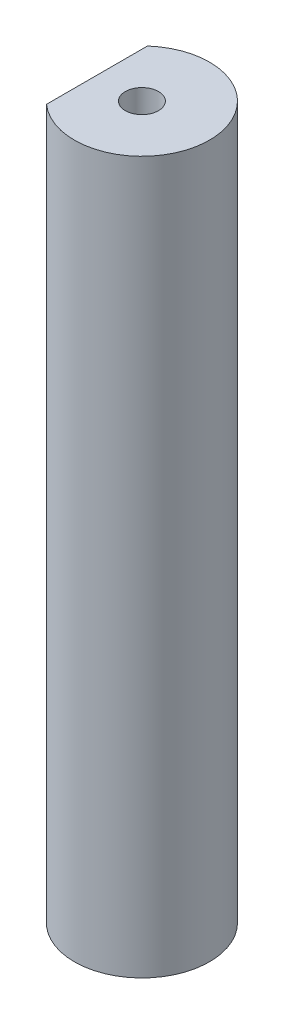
ISO-10303-21;
HEADER;
FILE_DESCRIPTION(('STEP AP214'),'2;1');
FILE_NAME('part.step','',(''),(''),'','','');
FILE_SCHEMA(('AUTOMOTIVE_DESIGN { 1 0 10303 214 1 1 1 1 }'));
ENDSEC;
DATA;
#1=APPLICATION_CONTEXT('core data for automotive mechanical design processes');
#2=APPLICATION_PROTOCOL_DEFINITION('international standard','automotive_design',2000,#1);
#3=PRODUCT_CONTEXT('',#1,'mechanical');
#4=PRODUCT('Part','Part','',(#3));
#5=PRODUCT_RELATED_PRODUCT_CATEGORY('part','',(#4));
#6=PRODUCT_DEFINITION_FORMATION('','',#4);
#7=PRODUCT_DEFINITION_CONTEXT('part definition',#1,'design');
#8=PRODUCT_DEFINITION('design','',#6,#7);
#9=PRODUCT_DEFINITION_SHAPE('','',#8);
#10=(LENGTH_UNIT() NAMED_UNIT(*) SI_UNIT(.MILLI.,.METRE.));
#11=(NAMED_UNIT(*) PLANE_ANGLE_UNIT() SI_UNIT($,.RADIAN.));
#12=(NAMED_UNIT(*) SI_UNIT($,.STERADIAN.) SOLID_ANGLE_UNIT());
#13=UNCERTAINTY_MEASURE_WITH_UNIT(LENGTH_MEASURE(1.E-05),#10,'distance_accuracy_value','');
#14=(GEOMETRIC_REPRESENTATION_CONTEXT(3) GLOBAL_UNCERTAINTY_ASSIGNED_CONTEXT((#13)) GLOBAL_UNIT_ASSIGNED_CONTEXT((#10,
#11,#12)) REPRESENTATION_CONTEXT('',''));
#15=CARTESIAN_POINT('',(0.,0.,0.));
#16=DIRECTION('',(0.,0.,1.));
#17=DIRECTION('',(1.,0.,0.));
#18=AXIS2_PLACEMENT_3D('',#15,#16,#17);
#19=CARTESIAN_POINT('',(0.,60.,0.));
#20=DIRECTION('',(0.,-1.,0.));
#21=DIRECTION('',(0.,0.,-1.));
#22=AXIS2_PLACEMENT_3D('',#19,#20,#21);
#23=CYLINDRICAL_SURFACE('',#22,5.7);
#24=CARTESIAN_POINT('',(0.,0.,0.));
#25=DIRECTION('',(0.,1.,0.));
#26=DIRECTION('',(0.,0.,1.));
#27=AXIS2_PLACEMENT_3D('',#24,#25,#26);
#28=CIRCLE('',#27,5.7);
#29=CARTESIAN_POINT('',(-3.79095568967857,0.,4.25660133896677));
#30=VERTEX_POINT('',#29);
#31=CARTESIAN_POINT('',(-3.79095568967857,0.,-4.25660133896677));
#32=VERTEX_POINT('',#31);
#33=EDGE_CURVE('E66',#30,#32,#28,.T.);
#34=ORIENTED_EDGE('',*,*,#33,.T.);
#35=DIRECTION('',(0.,-1.,0.));
#36=VECTOR('',#35,1.);
#37=CARTESIAN_POINT('',(-3.79095568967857,60.,-4.25660133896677));
#38=LINE('',#37,#36);
#39=CARTESIAN_POINT('',(-3.79095568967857,60.,-4.25660133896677));
#40=VERTEX_POINT('',#39);
#41=EDGE_CURVE('E11',#40,#32,#38,.T.);
#42=ORIENTED_EDGE('',*,*,#41,.F.);
#43=CARTESIAN_POINT('',(0.,60.,0.));
#44=DIRECTION('',(0.,1.,0.));
#45=DIRECTION('',(0.,0.,1.));
#46=AXIS2_PLACEMENT_3D('',#43,#44,#45);
#47=CIRCLE('',#46,5.7);
#48=CARTESIAN_POINT('',(-3.79095568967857,60.,4.25660133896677));
#49=VERTEX_POINT('',#48);
#50=EDGE_CURVE('E65',#49,#40,#47,.T.);
#51=ORIENTED_EDGE('',*,*,#50,.F.);
#52=DIRECTION('',(0.,-1.,0.));
#53=VECTOR('',#52,1.);
#54=CARTESIAN_POINT('',(-3.79095568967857,60.,4.25660133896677));
#55=LINE('',#54,#53);
#56=EDGE_CURVE('E43',#49,#30,#55,.T.);
#57=ORIENTED_EDGE('',*,*,#56,.T.);
#58=EDGE_LOOP('',(#34,#42,#51,#57));
#59=FACE_BOUND('',#58,.T.);
#60=ADVANCED_FACE('F35',(#59),#23,.T.);
#61=CARTESIAN_POINT('',(-3.79095568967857,60.,-4.25660133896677));
#62=DIRECTION('',(1.,0.,0.));
#63=DIRECTION('',(0.,0.,-1.));
#64=AXIS2_PLACEMENT_3D('',#61,#62,#63);
#65=PLANE('',#64);
#66=DIRECTION('',(0.,0.,1.));
#67=VECTOR('',#66,1.);
#68=CARTESIAN_POINT('',(-3.79095568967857,0.,-4.25660133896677));
#69=LINE('',#68,#67);
#70=EDGE_CURVE('E58',#32,#30,#69,.T.);
#71=ORIENTED_EDGE('',*,*,#70,.T.);
#72=ORIENTED_EDGE('',*,*,#56,.F.);
#73=DIRECTION('',(0.,0.,1.));
#74=VECTOR('',#73,1.);
#75=CARTESIAN_POINT('',(-3.79095568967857,60.,-4.25660133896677));
#76=LINE('',#75,#74);
#77=EDGE_CURVE('E50',#40,#49,#76,.T.);
#78=ORIENTED_EDGE('',*,*,#77,.F.);
#79=ORIENTED_EDGE('',*,*,#41,.T.);
#80=EDGE_LOOP('',(#71,#72,#78,#79));
#81=FACE_BOUND('',#80,.T.);
#82=ADVANCED_FACE('F61',(#81),#65,.F.);
#83=CARTESIAN_POINT('',(0.,60.,0.));
#84=DIRECTION('',(0.,1.,0.));
#85=DIRECTION('',(0.,0.,1.));
#86=AXIS2_PLACEMENT_3D('',#83,#84,#85);
#87=PLANE('',#86);
#88=CARTESIAN_POINT('',(0.,60.,0.));
#89=DIRECTION('',(0.,1.,0.));
#90=DIRECTION('',(0.,0.,1.));
#91=AXIS2_PLACEMENT_3D('',#88,#89,#90);
#92=CIRCLE('',#91,1.4);
#93=CARTESIAN_POINT('',(0.,60.,1.4));
#94=VERTEX_POINT('',#93);
#95=EDGE_CURVE('E73',#94,#94,#92,.T.);
#96=ORIENTED_EDGE('',*,*,#95,.F.);
#97=EDGE_LOOP('',(#96));
#98=FACE_BOUND('',#97,.T.);
#99=ORIENTED_EDGE('',*,*,#50,.T.);
#100=ORIENTED_EDGE('',*,*,#77,.T.);
#101=EDGE_LOOP('',(#99,#100));
#102=FACE_BOUND('',#101,.T.);
#103=ADVANCED_FACE('F98',(#98,#102),#87,.T.);
#104=CARTESIAN_POINT('',(0.,0.,0.));
#105=DIRECTION('',(0.,1.,0.));
#106=DIRECTION('',(0.,0.,1.));
#107=AXIS2_PLACEMENT_3D('',#104,#105,#106);
#108=PLANE('',#107);
#109=CARTESIAN_POINT('',(0.,0.,0.));
#110=DIRECTION('',(0.,-1.,0.));
#111=DIRECTION('',(0.,0.,-1.));
#112=AXIS2_PLACEMENT_3D('',#109,#110,#111);
#113=CIRCLE('',#112,1.4);
#114=CARTESIAN_POINT('',(0.,0.,-1.4));
#115=VERTEX_POINT('',#114);
#116=EDGE_CURVE('E81',#115,#115,#113,.T.);
#117=ORIENTED_EDGE('',*,*,#116,.F.);
#118=EDGE_LOOP('',(#117));
#119=FACE_BOUND('',#118,.T.);
#120=ORIENTED_EDGE('',*,*,#33,.F.);
#121=ORIENTED_EDGE('',*,*,#70,.F.);
#122=EDGE_LOOP('',(#120,#121));
#123=FACE_BOUND('',#122,.T.);
#124=ADVANCED_FACE('F69',(#119,#123),#108,.F.);
#125=CARTESIAN_POINT('',(0.,35.,0.));
#126=DIRECTION('',(0.,1.,0.));
#127=DIRECTION('',(0.,0.,1.));
#128=AXIS2_PLACEMENT_3D('',#125,#126,#127);
#129=CYLINDRICAL_SURFACE('',#128,1.4);
#130=CARTESIAN_POINT('',(0.,35.,0.));
#131=DIRECTION('',(0.,1.,0.));
#132=DIRECTION('',(0.,0.,1.));
#133=AXIS2_PLACEMENT_3D('',#130,#131,#132);
#134=CIRCLE('',#133,1.4);
#135=CARTESIAN_POINT('',(0.,35.,1.4));
#136=VERTEX_POINT('',#135);
#137=EDGE_CURVE('E70',#136,#136,#134,.T.);
#138=ORIENTED_EDGE('',*,*,#137,.F.);
#139=EDGE_LOOP('',(#138));
#140=FACE_BOUND('',#139,.T.);
#141=ORIENTED_EDGE('',*,*,#95,.T.);
#142=EDGE_LOOP('',(#141));
#143=FACE_BOUND('',#142,.T.);
#144=ADVANCED_FACE('F97',(#140,#143),#129,.F.);
#145=CARTESIAN_POINT('',(0.,35.,0.));
#146=DIRECTION('',(0.,1.,0.));
#147=DIRECTION('',(0.,0.,1.));
#148=AXIS2_PLACEMENT_3D('',#145,#146,#147);
#149=PLANE('',#148);
#150=ORIENTED_EDGE('',*,*,#137,.T.);
#151=EDGE_LOOP('',(#150));
#152=FACE_BOUND('',#151,.T.);
#153=ADVANCED_FACE('F92',(#152),#149,.T.);
#154=CARTESIAN_POINT('',(0.,25.,0.));
#155=DIRECTION('',(0.,-1.,0.));
#156=DIRECTION('',(0.,0.,-1.));
#157=AXIS2_PLACEMENT_3D('',#154,#155,#156);
#158=CYLINDRICAL_SURFACE('',#157,1.4);
#159=CARTESIAN_POINT('',(0.,25.,0.));
#160=DIRECTION('',(0.,-1.,0.));
#161=DIRECTION('',(0.,0.,-1.));
#162=AXIS2_PLACEMENT_3D('',#159,#160,#161);
#163=CIRCLE('',#162,1.4);
#164=CARTESIAN_POINT('',(0.,25.,-1.4));
#165=VERTEX_POINT('',#164);
#166=EDGE_CURVE('E79',#165,#165,#163,.T.);
#167=ORIENTED_EDGE('',*,*,#166,.F.);
#168=EDGE_LOOP('',(#167));
#169=FACE_BOUND('',#168,.T.);
#170=ORIENTED_EDGE('',*,*,#116,.T.);
#171=EDGE_LOOP('',(#170));
#172=FACE_BOUND('',#171,.T.);
#173=ADVANCED_FACE('F89',(#169,#172),#158,.F.);
#174=CARTESIAN_POINT('',(0.,25.,0.));
#175=DIRECTION('',(0.,-1.,0.));
#176=DIRECTION('',(0.,0.,-1.));
#177=AXIS2_PLACEMENT_3D('',#174,#175,#176);
#178=PLANE('',#177);
#179=ORIENTED_EDGE('',*,*,#166,.T.);
#180=EDGE_LOOP('',(#179));
#181=FACE_BOUND('',#180,.T.);
#182=ADVANCED_FACE('F87',(#181),#178,.T.);
#183=CLOSED_SHELL('',(#60,#82,#103,#124,#144,#153,#173,#182));
#184=MANIFOLD_SOLID_BREP('B2',#183);
#185=ADVANCED_BREP_SHAPE_REPRESENTATION('',(#18,#184),#14);
#186=SHAPE_DEFINITION_REPRESENTATION(#9,#185);
ENDSEC;
END-ISO-10303-21;
